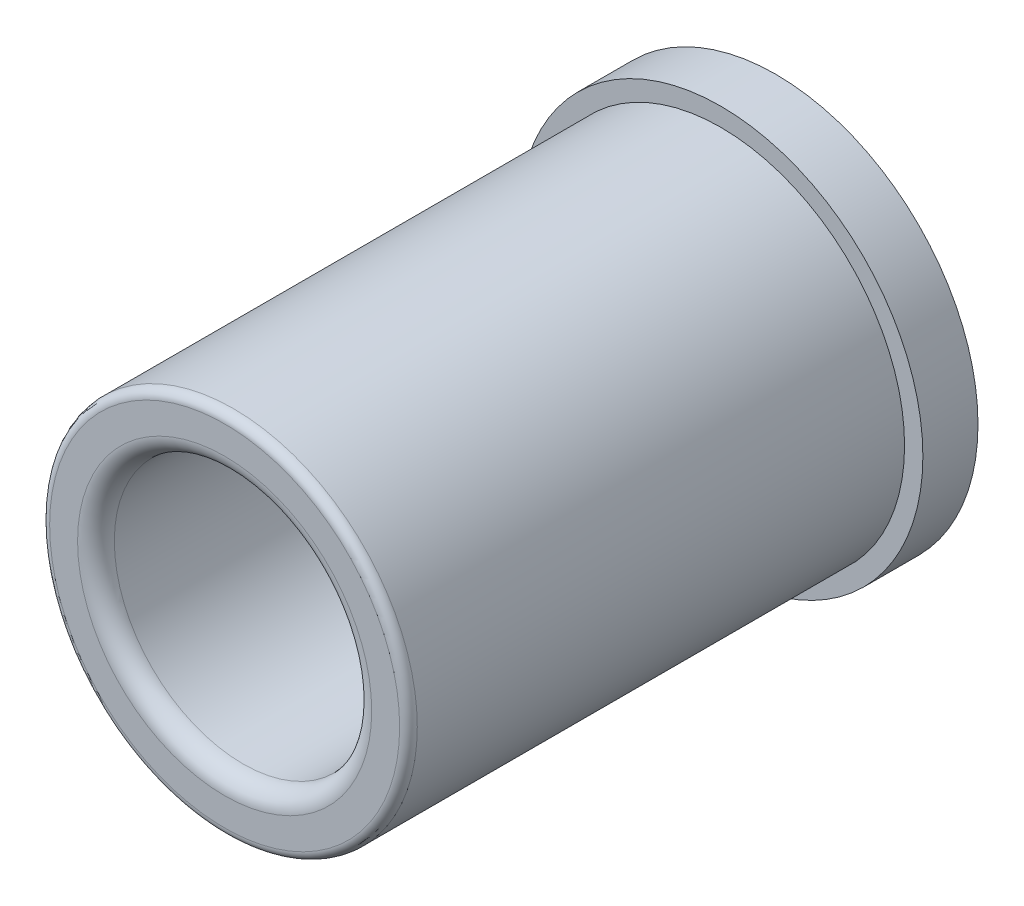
ISO-10303-21;
HEADER;
FILE_DESCRIPTION(('STEP AP214'),'2;1');
FILE_NAME('part.step','',(''),(''),'','','');
FILE_SCHEMA(('AUTOMOTIVE_DESIGN { 1 0 10303 214 1 1 1 1 }'));
ENDSEC;
DATA;
#1=APPLICATION_CONTEXT('core data for automotive mechanical design processes');
#2=APPLICATION_PROTOCOL_DEFINITION('international standard','automotive_design',2000,#1);
#3=PRODUCT_CONTEXT('',#1,'mechanical');
#4=PRODUCT('Part','Part','',(#3));
#5=PRODUCT_RELATED_PRODUCT_CATEGORY('part','',(#4));
#6=PRODUCT_DEFINITION_FORMATION('','',#4);
#7=PRODUCT_DEFINITION_CONTEXT('part definition',#1,'design');
#8=PRODUCT_DEFINITION('design','',#6,#7);
#9=PRODUCT_DEFINITION_SHAPE('','',#8);
#10=(LENGTH_UNIT() NAMED_UNIT(*) SI_UNIT(.MILLI.,.METRE.));
#11=(NAMED_UNIT(*) PLANE_ANGLE_UNIT() SI_UNIT($,.RADIAN.));
#12=(NAMED_UNIT(*) SI_UNIT($,.STERADIAN.) SOLID_ANGLE_UNIT());
#13=UNCERTAINTY_MEASURE_WITH_UNIT(LENGTH_MEASURE(1.E-05),#10,'distance_accuracy_value','');
#14=(GEOMETRIC_REPRESENTATION_CONTEXT(3) GLOBAL_UNCERTAINTY_ASSIGNED_CONTEXT((#13)) GLOBAL_UNIT_ASSIGNED_CONTEXT((#10,
#11,#12)) REPRESENTATION_CONTEXT('',''));
#15=CARTESIAN_POINT('',(0.,0.,0.));
#16=DIRECTION('',(0.,0.,1.));
#17=DIRECTION('',(1.,0.,0.));
#18=AXIS2_PLACEMENT_3D('',#15,#16,#17);
#19=CARTESIAN_POINT('',(0.,0.,42.8625));
#20=DIRECTION('',(0.,0.,-1.));
#21=DIRECTION('',(-1.,0.,0.));
#22=AXIS2_PLACEMENT_3D('',#19,#20,#21);
#23=CYLINDRICAL_SURFACE('',#22,11.11885);
#24=CARTESIAN_POINT('',(0.,0.,41.275));
#25=DIRECTION('',(0.,0.,1.));
#26=DIRECTION('',(1.,0.,0.));
#27=AXIS2_PLACEMENT_3D('',#24,#25,#26);
#28=CIRCLE('',#27,11.11885);
#29=CARTESIAN_POINT('',(11.11885,0.,41.275));
#30=VERTEX_POINT('',#29);
#31=EDGE_CURVE('E56',#30,#30,#28,.T.);
#32=ORIENTED_EDGE('',*,*,#31,.T.);
#33=EDGE_LOOP('',(#32));
#34=FACE_BOUND('',#33,.T.);
#35=CARTESIAN_POINT('',(0.,0.,-1.6129));
#36=DIRECTION('',(0.,0.,-1.));
#37=DIRECTION('',(-1.,0.,0.));
#38=AXIS2_PLACEMENT_3D('',#35,#36,#37);
#39=CIRCLE('',#38,11.11885);
#40=CARTESIAN_POINT('',(-11.11885,0.,-1.6129));
#41=VERTEX_POINT('',#40);
#42=EDGE_CURVE('E49',#41,#41,#39,.F.);
#43=ORIENTED_EDGE('',*,*,#42,.F.);
#44=EDGE_LOOP('',(#43));
#45=FACE_BOUND('',#44,.T.);
#46=ADVANCED_FACE('F31',(#34,#45),#23,.F.);
#47=CARTESIAN_POINT('',(0.,0.,0.));
#48=DIRECTION('',(0.,0.,-1.));
#49=DIRECTION('',(-1.,0.,0.));
#50=AXIS2_PLACEMENT_3D('',#47,#48,#49);
#51=CYLINDRICAL_SURFACE('',#50,17.4625);
#52=CARTESIAN_POINT('',(0.,0.,0.));
#53=DIRECTION('',(0.,0.,1.));
#54=DIRECTION('',(1.,0.,0.));
#55=AXIS2_PLACEMENT_3D('',#52,#53,#54);
#56=CIRCLE('',#55,17.4625);
#57=CARTESIAN_POINT('',(-17.4625,0.,0.));
#58=VERTEX_POINT('',#57);
#59=EDGE_CURVE('E62',#58,#58,#56,.T.);
#60=CARTESIAN_POINT('',(0.,0.,-4.7625));
#61=DIRECTION('',(0.,0.,1.));
#62=DIRECTION('',(1.,0.,0.));
#63=AXIS2_PLACEMENT_3D('',#60,#61,#62);
#64=CIRCLE('',#63,17.4625);
#65=CARTESIAN_POINT('',(-17.4625,0.,-4.7625));
#66=VERTEX_POINT('',#65);
#67=EDGE_CURVE('E63',#66,#66,#64,.T.);
#68=CARTESIAN_POINT('',(-17.4625,0.,0.));
#69=CARTESIAN_POINT('',(-17.4625,0.,-0.049609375));
#70=CARTESIAN_POINT('',(-17.4625,0.,-0.09921875));
#71=CARTESIAN_POINT('',(-17.4625,0.,-0.1984375));
#72=CARTESIAN_POINT('',(-17.4625,0.,-0.248046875));
#73=CARTESIAN_POINT('',(-17.4625,0.,-0.347265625));
#74=CARTESIAN_POINT('',(-17.4625,0.,-0.396875));
#75=CARTESIAN_POINT('',(-17.4625,0.,-0.49609375));
#76=CARTESIAN_POINT('',(-17.4625,0.,-0.545703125));
#77=CARTESIAN_POINT('',(-17.4625,0.,-0.644921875));
#78=CARTESIAN_POINT('',(-17.4625,0.,-0.69453125));
#79=CARTESIAN_POINT('',(-17.4625,0.,-0.79375));
#80=CARTESIAN_POINT('',(-17.4625,0.,-0.843359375));
#81=CARTESIAN_POINT('',(-17.4625,0.,-0.942578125));
#82=CARTESIAN_POINT('',(-17.4625,0.,-0.9921875));
#83=CARTESIAN_POINT('',(-17.4625,0.,-1.09140625));
#84=CARTESIAN_POINT('',(-17.4625,0.,-1.141015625));
#85=CARTESIAN_POINT('',(-17.4625,0.,-1.240234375));
#86=CARTESIAN_POINT('',(-17.4625,0.,-1.28984375));
#87=CARTESIAN_POINT('',(-17.4625,0.,-1.3890625));
#88=CARTESIAN_POINT('',(-17.4625,0.,-1.438671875));
#89=CARTESIAN_POINT('',(-17.4625,0.,-1.537890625));
#90=CARTESIAN_POINT('',(-17.4625,0.,-1.5875));
#91=CARTESIAN_POINT('',(-17.4625,0.,-1.68671875));
#92=CARTESIAN_POINT('',(-17.4625,0.,-1.736328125));
#93=CARTESIAN_POINT('',(-17.4625,0.,-1.835546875));
#94=CARTESIAN_POINT('',(-17.4625,0.,-1.88515625));
#95=CARTESIAN_POINT('',(-17.4625,0.,-1.984375));
#96=CARTESIAN_POINT('',(-17.4625,0.,-2.033984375));
#97=CARTESIAN_POINT('',(-17.4625,0.,-2.133203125));
#98=CARTESIAN_POINT('',(-17.4625,0.,-2.1828125));
#99=CARTESIAN_POINT('',(-17.4625,0.,-2.28203125));
#100=CARTESIAN_POINT('',(-17.4625,0.,-2.331640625));
#101=CARTESIAN_POINT('',(-17.4625,0.,-2.430859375));
#102=CARTESIAN_POINT('',(-17.4625,0.,-2.48046875));
#103=CARTESIAN_POINT('',(-17.4625,0.,-2.5796875));
#104=CARTESIAN_POINT('',(-17.4625,0.,-2.629296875));
#105=CARTESIAN_POINT('',(-17.4625,0.,-2.728515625));
#106=CARTESIAN_POINT('',(-17.4625,0.,-2.778125));
#107=CARTESIAN_POINT('',(-17.4625,0.,-2.87734375));
#108=CARTESIAN_POINT('',(-17.4625,0.,-2.926953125));
#109=CARTESIAN_POINT('',(-17.4625,0.,-3.026171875));
#110=CARTESIAN_POINT('',(-17.4625,0.,-3.07578125));
#111=CARTESIAN_POINT('',(-17.4625,0.,-3.175));
#112=CARTESIAN_POINT('',(-17.4625,0.,-3.224609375));
#113=CARTESIAN_POINT('',(-17.4625,0.,-3.323828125));
#114=CARTESIAN_POINT('',(-17.4625,0.,-3.3734375));
#115=CARTESIAN_POINT('',(-17.4625,0.,-3.47265625));
#116=CARTESIAN_POINT('',(-17.4625,0.,-3.522265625));
#117=CARTESIAN_POINT('',(-17.4625,0.,-3.621484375));
#118=CARTESIAN_POINT('',(-17.4625,0.,-3.67109375));
#119=CARTESIAN_POINT('',(-17.4625,0.,-3.7703125));
#120=CARTESIAN_POINT('',(-17.4625,0.,-3.819921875));
#121=CARTESIAN_POINT('',(-17.4625,0.,-3.919140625));
#122=CARTESIAN_POINT('',(-17.4625,0.,-3.96875));
#123=CARTESIAN_POINT('',(-17.4625,0.,-4.06796875));
#124=CARTESIAN_POINT('',(-17.4625,0.,-4.117578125));
#125=CARTESIAN_POINT('',(-17.4625,0.,-4.216796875));
#126=CARTESIAN_POINT('',(-17.4625,0.,-4.26640625));
#127=CARTESIAN_POINT('',(-17.4625,0.,-4.365625));
#128=CARTESIAN_POINT('',(-17.4625,0.,-4.415234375));
#129=CARTESIAN_POINT('',(-17.4625,0.,-4.514453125));
#130=CARTESIAN_POINT('',(-17.4625,0.,-4.5640625));
#131=CARTESIAN_POINT('',(-17.4625,0.,-4.66328125));
#132=CARTESIAN_POINT('',(-17.4625,0.,-4.712890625));
#133=CARTESIAN_POINT('',(-17.4625,0.,-4.7625));
#134=B_SPLINE_CURVE_WITH_KNOTS('',3,(#68,#69,#70,#71,#72,#73,#74,#75,#76,#77,#78,#79,#80,#81,
#82,#83,#84,#85,#86,#87,#88,#89,#90,#91,#92,#93,#94,#95,#96,#97,#98,#99,#100,#101,#102,#103,
#104,#105,#106,#107,#108,#109,#110,#111,#112,#113,#114,#115,#116,#117,#118,#119,#120,#121,#122,
#123,#124,#125,#126,#127,#128,#129,#130,#131,#132,#133),.UNSPECIFIED.,.F.,.F.,(4,2,2,2,2,2,2,2,
2,2,2,2,2,2,2,2,2,2,2,2,2,2,2,2,2,2,2,2,2,2,2,2,4),(0.,0.148828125,0.29765625,0.446484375,
0.5953125,0.744140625,0.89296875,1.041796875,1.190625,1.339453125,1.48828125,1.637109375,
1.7859375,1.934765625,2.08359375,2.232421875,2.38125,2.530078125,2.67890625,2.827734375,
2.9765625,3.125390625,3.27421875,3.423046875,3.571875,3.720703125,3.86953125,4.018359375,
4.1671875,4.316015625,4.46484375,4.613671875,4.7625),.UNSPECIFIED.);
#135=EDGE_CURVE('BSEAM88',#58,#66,#134,.T.);
#136=ORIENTED_EDGE('',*,*,#59,.F.);
#137=ORIENTED_EDGE('',*,*,#67,.T.);
#138=ORIENTED_EDGE('',*,*,#135,.T.);
#139=ORIENTED_EDGE('',*,*,#135,.F.);
#140=EDGE_LOOP('',(#136,#138,#137,#139));
#141=FACE_BOUND('',#140,.T.);
#142=ADVANCED_FACE('F88',(#141),#51,.T.);
#143=CARTESIAN_POINT('',(0.,0.,0.));
#144=DIRECTION('',(0.,0.,1.));
#145=DIRECTION('',(1.,0.,0.));
#146=AXIS2_PLACEMENT_3D('',#143,#144,#145);
#147=PLANE('',#146);
#148=CARTESIAN_POINT('',(0.,0.,0.));
#149=DIRECTION('',(0.,0.,1.));
#150=DIRECTION('',(1.,0.,0.));
#151=AXIS2_PLACEMENT_3D('',#148,#149,#150);
#152=CIRCLE('',#151,15.88135);
#153=CARTESIAN_POINT('',(15.88135,0.,0.));
#154=VERTEX_POINT('',#153);
#155=EDGE_CURVE('E51',#154,#154,#152,.T.);
#156=ORIENTED_EDGE('',*,*,#155,.F.);
#157=EDGE_LOOP('',(#156));
#158=FACE_BOUND('',#157,.T.);
#159=ORIENTED_EDGE('',*,*,#59,.T.);
#160=EDGE_LOOP('',(#159));
#161=FACE_BOUND('',#160,.T.);
#162=ADVANCED_FACE('F93',(#158,#161),#147,.T.);
#163=CARTESIAN_POINT('',(0.,0.,-4.7625));
#164=DIRECTION('',(0.,0.,1.));
#165=DIRECTION('',(1.,0.,0.));
#166=AXIS2_PLACEMENT_3D('',#163,#164,#165);
#167=PLANE('',#166);
#168=CARTESIAN_POINT('',(0.,0.,-4.7625));
#169=DIRECTION('',(0.,0.,1.));
#170=DIRECTION('',(1.,0.,0.));
#171=AXIS2_PLACEMENT_3D('',#168,#169,#170);
#172=CIRCLE('',#171,12.2936);
#173=CARTESIAN_POINT('',(12.2936,0.,-4.7625));
#174=VERTEX_POINT('',#173);
#175=EDGE_CURVE('E10',#174,#174,#172,.T.);
#176=ORIENTED_EDGE('',*,*,#175,.T.);
#177=EDGE_LOOP('',(#176));
#178=FACE_BOUND('',#177,.T.);
#179=ORIENTED_EDGE('',*,*,#67,.F.);
#180=EDGE_LOOP('',(#179));
#181=FACE_BOUND('',#180,.T.);
#182=ADVANCED_FACE('F106',(#178,#181),#167,.F.);
#183=CARTESIAN_POINT('',(0.,0.,42.8625));
#184=DIRECTION('',(0.,0.,-1.));
#185=DIRECTION('',(-1.,0.,0.));
#186=AXIS2_PLACEMENT_3D('',#183,#184,#185);
#187=CYLINDRICAL_SURFACE('',#186,15.88135);
#188=CARTESIAN_POINT('',(0.,0.,42.1005));
#189=DIRECTION('',(0.,0.,1.));
#190=DIRECTION('',(1.,0.,0.));
#191=AXIS2_PLACEMENT_3D('',#188,#189,#190);
#192=CIRCLE('',#191,15.88135);
#193=CARTESIAN_POINT('',(15.88135,0.,42.1005));
#194=VERTEX_POINT('',#193);
#195=EDGE_CURVE('E42',#194,#194,#192,.F.);
#196=ORIENTED_EDGE('',*,*,#195,.T.);
#197=EDGE_LOOP('',(#196));
#198=FACE_BOUND('',#197,.T.);
#199=ORIENTED_EDGE('',*,*,#155,.T.);
#200=EDGE_LOOP('',(#199));
#201=FACE_BOUND('',#200,.T.);
#202=ADVANCED_FACE('F102',(#198,#201),#187,.T.);
#203=CARTESIAN_POINT('',(0.,0.,42.8625));
#204=DIRECTION('',(0.,0.,1.));
#205=DIRECTION('',(1.,0.,0.));
#206=AXIS2_PLACEMENT_3D('',#203,#204,#205);
#207=PLANE('',#206);
#208=CARTESIAN_POINT('',(0.,0.,42.8625));
#209=DIRECTION('',(0.,0.,1.));
#210=DIRECTION('',(1.,0.,0.));
#211=AXIS2_PLACEMENT_3D('',#208,#209,#210);
#212=CIRCLE('',#211,15.11935);
#213=CARTESIAN_POINT('',(15.11935,0.,42.8625));
#214=VERTEX_POINT('',#213);
#215=EDGE_CURVE('E46',#214,#214,#212,.T.);
#216=ORIENTED_EDGE('',*,*,#215,.T.);
#217=EDGE_LOOP('',(#216));
#218=FACE_BOUND('',#217,.T.);
#219=CARTESIAN_POINT('',(0.,0.,42.8625));
#220=DIRECTION('',(0.,0.,1.));
#221=DIRECTION('',(1.,0.,0.));
#222=AXIS2_PLACEMENT_3D('',#219,#220,#221);
#223=CIRCLE('',#222,12.70635);
#224=CARTESIAN_POINT('',(12.70635,0.,42.8625));
#225=VERTEX_POINT('',#224);
#226=EDGE_CURVE('E59',#225,#225,#223,.F.);
#227=ORIENTED_EDGE('',*,*,#226,.T.);
#228=EDGE_LOOP('',(#227));
#229=FACE_BOUND('',#228,.T.);
#230=ADVANCED_FACE('F98',(#218,#229),#207,.T.);
#231=CARTESIAN_POINT('',(0.,0.,41.275));
#232=DIRECTION('',(0.,0.,1.));
#233=DIRECTION('',(1.,0.,0.));
#234=AXIS2_PLACEMENT_3D('',#231,#232,#233);
#235=TOROIDAL_SURFACE('',#234,12.70635,1.5875);
#236=ORIENTED_EDGE('',*,*,#31,.F.);
#237=EDGE_LOOP('',(#236));
#238=FACE_BOUND('',#237,.T.);
#239=ORIENTED_EDGE('',*,*,#226,.F.);
#240=EDGE_LOOP('',(#239));
#241=FACE_BOUND('',#240,.T.);
#242=ADVANCED_FACE('F101',(#238,#241),#235,.T.);
#243=CARTESIAN_POINT('',(0.,0.,42.1005));
#244=DIRECTION('',(0.,0.,1.));
#245=DIRECTION('',(1.,0.,0.));
#246=AXIS2_PLACEMENT_3D('',#243,#244,#245);
#247=TOROIDAL_SURFACE('',#246,15.11935,0.762);
#248=ORIENTED_EDGE('',*,*,#195,.F.);
#249=EDGE_LOOP('',(#248));
#250=FACE_BOUND('',#249,.T.);
#251=ORIENTED_EDGE('',*,*,#215,.F.);
#252=EDGE_LOOP('',(#251));
#253=FACE_BOUND('',#252,.T.);
#254=ADVANCED_FACE('F84',(#250,#253),#247,.T.);
#255=CARTESIAN_POINT('',(0.,0.,-1.6129));
#256=DIRECTION('',(0.,0.,-1.));
#257=DIRECTION('',(-1.,0.,0.));
#258=AXIS2_PLACEMENT_3D('',#255,#256,#257);
#259=PLANE('',#258);
#260=CARTESIAN_POINT('',(0.,0.,-1.6129));
#261=DIRECTION('',(0.,0.,-1.));
#262=DIRECTION('',(-1.,0.,0.));
#263=AXIS2_PLACEMENT_3D('',#260,#261,#262);
#264=CIRCLE('',#263,11.49985);
#265=CARTESIAN_POINT('',(-11.49985,0.,-1.6129));
#266=VERTEX_POINT('',#265);
#267=EDGE_CURVE('E52',#266,#266,#264,.T.);
#268=ORIENTED_EDGE('',*,*,#267,.T.);
#269=EDGE_LOOP('',(#268));
#270=FACE_BOUND('',#269,.T.);
#271=ORIENTED_EDGE('',*,*,#42,.T.);
#272=EDGE_LOOP('',(#271));
#273=FACE_BOUND('',#272,.T.);
#274=ADVANCED_FACE('F73',(#270,#273),#259,.T.);
#275=CARTESIAN_POINT('',(0.,0.,-1.6129));
#276=DIRECTION('',(0.,0.,-1.));
#277=DIRECTION('',(-1.,0.,0.));
#278=AXIS2_PLACEMENT_3D('',#275,#276,#277);
#279=CYLINDRICAL_SURFACE('',#278,11.49985);
#280=CARTESIAN_POINT('',(0.,0.,-3.96874999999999));
#281=DIRECTION('',(0.,0.,1.));
#282=DIRECTION('',(1.,0.,0.));
#283=AXIS2_PLACEMENT_3D('',#280,#281,#282);
#284=CIRCLE('',#283,11.49985);
#285=CARTESIAN_POINT('',(11.49985,0.,-3.96874999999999));
#286=VERTEX_POINT('',#285);
#287=EDGE_CURVE('E38',#286,#286,#284,.F.);
#288=ORIENTED_EDGE('',*,*,#287,.T.);
#289=EDGE_LOOP('',(#288));
#290=FACE_BOUND('',#289,.T.);
#291=ORIENTED_EDGE('',*,*,#267,.F.);
#292=EDGE_LOOP('',(#291));
#293=FACE_BOUND('',#292,.T.);
#294=ADVANCED_FACE('F76',(#290,#293),#279,.F.);
#295=CARTESIAN_POINT('',(0.,0.,-3.96874999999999));
#296=DIRECTION('',(0.,0.,-1.));
#297=DIRECTION('',(-1.,0.,0.));
#298=AXIS2_PLACEMENT_3D('',#295,#296,#297);
#299=CONICAL_SURFACE('',#298,11.49985,0.785398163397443);
#300=ORIENTED_EDGE('',*,*,#175,.F.);
#301=EDGE_LOOP('',(#300));
#302=FACE_BOUND('',#301,.T.);
#303=ORIENTED_EDGE('',*,*,#287,.F.);
#304=EDGE_LOOP('',(#303));
#305=FACE_BOUND('',#304,.T.);
#306=ADVANCED_FACE('F33',(#302,#305),#299,.F.);
#307=CLOSED_SHELL('',(#46,#142,#162,#182,#202,#230,#242,#254,#274,#294,#306));
#308=MANIFOLD_SOLID_BREP('B2',#307);
#309=ADVANCED_BREP_SHAPE_REPRESENTATION('',(#18,#308),#14);
#310=SHAPE_DEFINITION_REPRESENTATION(#9,#309);
ENDSEC;
END-ISO-10303-21;
